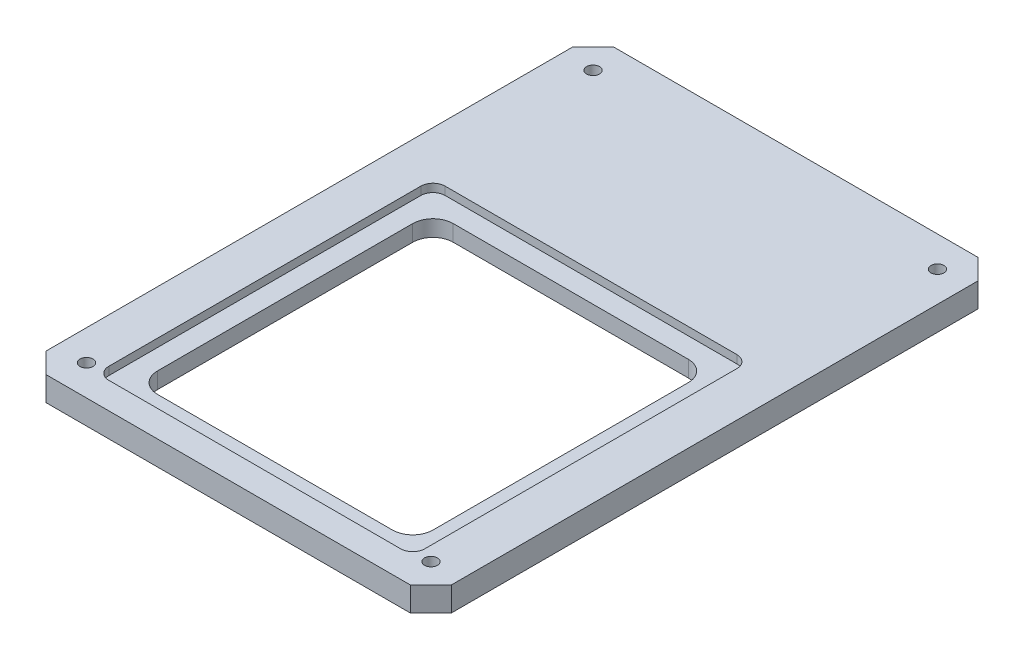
ISO-10303-21;
HEADER;
FILE_DESCRIPTION(('STEP AP214'),'2;1');
FILE_NAME('part.step','',(''),(''),'','','');
FILE_SCHEMA(('AUTOMOTIVE_DESIGN { 1 0 10303 214 1 1 1 1 }'));
ENDSEC;
DATA;
#1=APPLICATION_CONTEXT('core data for automotive mechanical design processes');
#2=APPLICATION_PROTOCOL_DEFINITION('international standard','automotive_design',2000,#1);
#3=PRODUCT_CONTEXT('',#1,'mechanical');
#4=PRODUCT('Part','Part','',(#3));
#5=PRODUCT_RELATED_PRODUCT_CATEGORY('part','',(#4));
#6=PRODUCT_DEFINITION_FORMATION('','',#4);
#7=PRODUCT_DEFINITION_CONTEXT('part definition',#1,'design');
#8=PRODUCT_DEFINITION('design','',#6,#7);
#9=PRODUCT_DEFINITION_SHAPE('','',#8);
#10=(LENGTH_UNIT() NAMED_UNIT(*) SI_UNIT(.MILLI.,.METRE.));
#11=(NAMED_UNIT(*) PLANE_ANGLE_UNIT() SI_UNIT($,.RADIAN.));
#12=(NAMED_UNIT(*) SI_UNIT($,.STERADIAN.) SOLID_ANGLE_UNIT());
#13=UNCERTAINTY_MEASURE_WITH_UNIT(LENGTH_MEASURE(1.E-05),#10,'distance_accuracy_value','');
#14=(GEOMETRIC_REPRESENTATION_CONTEXT(3) GLOBAL_UNCERTAINTY_ASSIGNED_CONTEXT((#13)) GLOBAL_UNIT_ASSIGNED_CONTEXT((#10,
#11,#12)) REPRESENTATION_CONTEXT('',''));
#15=CARTESIAN_POINT('',(0.,0.,0.));
#16=DIRECTION('',(0.,0.,1.));
#17=DIRECTION('',(1.,0.,0.));
#18=AXIS2_PLACEMENT_3D('',#15,#16,#17);
#19=CARTESIAN_POINT('',(18.5,6.,-82.5));
#20=DIRECTION('',(0.,-1.,0.));
#21=DIRECTION('',(0.,0.,-1.));
#22=AXIS2_PLACEMENT_3D('',#19,#20,#21);
#23=CYLINDRICAL_SURFACE('',#22,5.);
#24=DIRECTION('',(0.,-1.,0.));
#25=VECTOR('',#24,1.);
#26=CARTESIAN_POINT('',(18.5,6.,-87.5));
#27=LINE('',#26,#25);
#28=CARTESIAN_POINT('',(18.5,4.,-87.5));
#29=VERTEX_POINT('',#28);
#30=CARTESIAN_POINT('',(18.5,0.,-87.5));
#31=VERTEX_POINT('',#30);
#32=EDGE_CURVE('E312',#29,#31,#27,.T.);
#33=ORIENTED_EDGE('',*,*,#32,.F.);
#34=CARTESIAN_POINT('',(18.5,4.,-82.5));
#35=DIRECTION('',(0.,1.,0.));
#36=DIRECTION('',(0.,0.,1.));
#37=AXIS2_PLACEMENT_3D('',#34,#35,#36);
#38=CIRCLE('',#37,5.);
#39=CARTESIAN_POINT('',(13.5,4.,-82.5));
#40=VERTEX_POINT('',#39);
#41=EDGE_CURVE('E53',#29,#40,#38,.T.);
#42=ORIENTED_EDGE('',*,*,#41,.T.);
#43=DIRECTION('',(0.,-1.,0.));
#44=VECTOR('',#43,1.);
#45=CARTESIAN_POINT('',(13.5,6.,-82.5));
#46=LINE('',#45,#44);
#47=CARTESIAN_POINT('',(13.5,0.,-82.5));
#48=VERTEX_POINT('',#47);
#49=EDGE_CURVE('E326',#40,#48,#46,.T.);
#50=ORIENTED_EDGE('',*,*,#49,.T.);
#51=CARTESIAN_POINT('',(18.5,0.,-82.5));
#52=DIRECTION('',(0.,1.,0.));
#53=DIRECTION('',(0.,0.,1.));
#54=AXIS2_PLACEMENT_3D('',#51,#52,#53);
#55=CIRCLE('',#54,5.);
#56=EDGE_CURVE('E288',#31,#48,#55,.T.);
#57=ORIENTED_EDGE('',*,*,#56,.F.);
#58=EDGE_LOOP('',(#33,#42,#50,#57));
#59=FACE_BOUND('',#58,.T.);
#60=ADVANCED_FACE('F30',(#59),#23,.F.);
#61=CARTESIAN_POINT('',(13.5,6.,-82.5));
#62=DIRECTION('',(1.,0.,0.));
#63=DIRECTION('',(0.,0.,-1.));
#64=AXIS2_PLACEMENT_3D('',#61,#62,#63);
#65=PLANE('',#64);
#66=ORIENTED_EDGE('',*,*,#49,.F.);
#67=DIRECTION('',(0.,0.,1.));
#68=VECTOR('',#67,1.);
#69=CARTESIAN_POINT('',(13.5,4.,-82.5));
#70=LINE('',#69,#68);
#71=CARTESIAN_POINT('',(13.5,4.,-19.5));
#72=VERTEX_POINT('',#71);
#73=EDGE_CURVE('E278',#40,#72,#70,.T.);
#74=ORIENTED_EDGE('',*,*,#73,.T.);
#75=DIRECTION('',(0.,-1.,0.));
#76=VECTOR('',#75,1.);
#77=CARTESIAN_POINT('',(13.5,6.,-19.5));
#78=LINE('',#77,#76);
#79=CARTESIAN_POINT('',(13.5,0.,-19.5));
#80=VERTEX_POINT('',#79);
#81=EDGE_CURVE('E324',#72,#80,#78,.T.);
#82=ORIENTED_EDGE('',*,*,#81,.T.);
#83=DIRECTION('',(0.,0.,1.));
#84=VECTOR('',#83,1.);
#85=CARTESIAN_POINT('',(13.5,0.,-82.5));
#86=LINE('',#85,#84);
#87=EDGE_CURVE('E291',#48,#80,#86,.T.);
#88=ORIENTED_EDGE('',*,*,#87,.F.);
#89=EDGE_LOOP('',(#66,#74,#82,#88));
#90=FACE_BOUND('',#89,.T.);
#91=ADVANCED_FACE('F452',(#90),#65,.T.);
#92=CARTESIAN_POINT('',(18.5,6.,-19.5));
#93=DIRECTION('',(0.,-1.,0.));
#94=DIRECTION('',(0.,0.,-1.));
#95=AXIS2_PLACEMENT_3D('',#92,#93,#94);
#96=CYLINDRICAL_SURFACE('',#95,5.);
#97=ORIENTED_EDGE('',*,*,#81,.F.);
#98=CARTESIAN_POINT('',(18.5,4.,-19.5));
#99=DIRECTION('',(0.,1.,0.));
#100=DIRECTION('',(0.,0.,1.));
#101=AXIS2_PLACEMENT_3D('',#98,#99,#100);
#102=CIRCLE('',#101,5.);
#103=CARTESIAN_POINT('',(18.5,4.,-14.5));
#104=VERTEX_POINT('',#103);
#105=EDGE_CURVE('E275',#72,#104,#102,.T.);
#106=ORIENTED_EDGE('',*,*,#105,.T.);
#107=DIRECTION('',(0.,-1.,0.));
#108=VECTOR('',#107,1.);
#109=CARTESIAN_POINT('',(18.5,6.,-14.5));
#110=LINE('',#109,#108);
#111=CARTESIAN_POINT('',(18.5,0.,-14.5));
#112=VERTEX_POINT('',#111);
#113=EDGE_CURVE('E322',#104,#112,#110,.T.);
#114=ORIENTED_EDGE('',*,*,#113,.T.);
#115=CARTESIAN_POINT('',(18.5,0.,-19.5));
#116=DIRECTION('',(0.,1.,0.));
#117=DIRECTION('',(0.,0.,1.));
#118=AXIS2_PLACEMENT_3D('',#115,#116,#117);
#119=CIRCLE('',#118,5.);
#120=EDGE_CURVE('E294',#80,#112,#119,.T.);
#121=ORIENTED_EDGE('',*,*,#120,.F.);
#122=EDGE_LOOP('',(#97,#106,#114,#121));
#123=FACE_BOUND('',#122,.T.);
#124=ADVANCED_FACE('F458',(#123),#96,.F.);
#125=CARTESIAN_POINT('',(18.5,6.,-14.5));
#126=DIRECTION('',(0.,0.,-1.));
#127=DIRECTION('',(-1.,0.,0.));
#128=AXIS2_PLACEMENT_3D('',#125,#126,#127);
#129=PLANE('',#128);
#130=ORIENTED_EDGE('',*,*,#113,.F.);
#131=DIRECTION('',(1.,0.,0.));
#132=VECTOR('',#131,1.);
#133=CARTESIAN_POINT('',(18.5,4.,-14.5));
#134=LINE('',#133,#132);
#135=CARTESIAN_POINT('',(76.5,4.,-14.5));
#136=VERTEX_POINT('',#135);
#137=EDGE_CURVE('E272',#104,#136,#134,.T.);
#138=ORIENTED_EDGE('',*,*,#137,.T.);
#139=DIRECTION('',(0.,-1.,0.));
#140=VECTOR('',#139,1.);
#141=CARTESIAN_POINT('',(76.5,6.,-14.5));
#142=LINE('',#141,#140);
#143=CARTESIAN_POINT('',(76.5,0.,-14.5));
#144=VERTEX_POINT('',#143);
#145=EDGE_CURVE('E320',#136,#144,#142,.T.);
#146=ORIENTED_EDGE('',*,*,#145,.T.);
#147=DIRECTION('',(1.,0.,0.));
#148=VECTOR('',#147,1.);
#149=CARTESIAN_POINT('',(18.5,0.,-14.5));
#150=LINE('',#149,#148);
#151=EDGE_CURVE('E297',#112,#144,#150,.T.);
#152=ORIENTED_EDGE('',*,*,#151,.F.);
#153=EDGE_LOOP('',(#130,#138,#146,#152));
#154=FACE_BOUND('',#153,.T.);
#155=ADVANCED_FACE('F615',(#154),#129,.T.);
#156=CARTESIAN_POINT('',(76.5,6.,-19.5));
#157=DIRECTION('',(0.,-1.,0.));
#158=DIRECTION('',(0.,0.,-1.));
#159=AXIS2_PLACEMENT_3D('',#156,#157,#158);
#160=CYLINDRICAL_SURFACE('',#159,5.);
#161=ORIENTED_EDGE('',*,*,#145,.F.);
#162=CARTESIAN_POINT('',(76.5,4.,-19.5));
#163=DIRECTION('',(0.,1.,0.));
#164=DIRECTION('',(0.,0.,1.));
#165=AXIS2_PLACEMENT_3D('',#162,#163,#164);
#166=CIRCLE('',#165,5.);
#167=CARTESIAN_POINT('',(81.5,4.,-19.5));
#168=VERTEX_POINT('',#167);
#169=EDGE_CURVE('E269',#136,#168,#166,.T.);
#170=ORIENTED_EDGE('',*,*,#169,.T.);
#171=DIRECTION('',(0.,-1.,0.));
#172=VECTOR('',#171,1.);
#173=CARTESIAN_POINT('',(81.5,6.,-19.5));
#174=LINE('',#173,#172);
#175=CARTESIAN_POINT('',(81.5,0.,-19.5));
#176=VERTEX_POINT('',#175);
#177=EDGE_CURVE('E318',#168,#176,#174,.T.);
#178=ORIENTED_EDGE('',*,*,#177,.T.);
#179=CARTESIAN_POINT('',(76.5,0.,-19.5));
#180=DIRECTION('',(0.,1.,0.));
#181=DIRECTION('',(0.,0.,1.));
#182=AXIS2_PLACEMENT_3D('',#179,#180,#181);
#183=CIRCLE('',#182,5.);
#184=EDGE_CURVE('E300',#144,#176,#183,.T.);
#185=ORIENTED_EDGE('',*,*,#184,.F.);
#186=EDGE_LOOP('',(#161,#170,#178,#185));
#187=FACE_BOUND('',#186,.T.);
#188=ADVANCED_FACE('F623',(#187),#160,.F.);
#189=CARTESIAN_POINT('',(81.5,6.,-82.5));
#190=DIRECTION('',(-1.,0.,0.));
#191=DIRECTION('',(0.,0.,1.));
#192=AXIS2_PLACEMENT_3D('',#189,#190,#191);
#193=PLANE('',#192);
#194=ORIENTED_EDGE('',*,*,#177,.F.);
#195=DIRECTION('',(0.,0.,-1.));
#196=VECTOR('',#195,1.);
#197=CARTESIAN_POINT('',(81.5,4.,-82.5));
#198=LINE('',#197,#196);
#199=CARTESIAN_POINT('',(81.5,4.,-82.5));
#200=VERTEX_POINT('',#199);
#201=EDGE_CURVE('E266',#168,#200,#198,.T.);
#202=ORIENTED_EDGE('',*,*,#201,.T.);
#203=DIRECTION('',(0.,-1.,0.));
#204=VECTOR('',#203,1.);
#205=CARTESIAN_POINT('',(81.5,6.,-82.5));
#206=LINE('',#205,#204);
#207=CARTESIAN_POINT('',(81.5,0.,-82.5));
#208=VERTEX_POINT('',#207);
#209=EDGE_CURVE('E316',#200,#208,#206,.T.);
#210=ORIENTED_EDGE('',*,*,#209,.T.);
#211=DIRECTION('',(0.,0.,-1.));
#212=VECTOR('',#211,1.);
#213=CARTESIAN_POINT('',(81.5,0.,-82.5));
#214=LINE('',#213,#212);
#215=EDGE_CURVE('E303',#176,#208,#214,.T.);
#216=ORIENTED_EDGE('',*,*,#215,.F.);
#217=EDGE_LOOP('',(#194,#202,#210,#216));
#218=FACE_BOUND('',#217,.T.);
#219=ADVANCED_FACE('F632',(#218),#193,.T.);
#220=CARTESIAN_POINT('',(76.5,6.,-82.5));
#221=DIRECTION('',(0.,-1.,0.));
#222=DIRECTION('',(0.,0.,-1.));
#223=AXIS2_PLACEMENT_3D('',#220,#221,#222);
#224=CYLINDRICAL_SURFACE('',#223,5.);
#225=ORIENTED_EDGE('',*,*,#209,.F.);
#226=CARTESIAN_POINT('',(76.5,4.,-82.5));
#227=DIRECTION('',(0.,1.,0.));
#228=DIRECTION('',(0.,0.,1.));
#229=AXIS2_PLACEMENT_3D('',#226,#227,#228);
#230=CIRCLE('',#229,5.);
#231=CARTESIAN_POINT('',(76.5,4.,-87.5));
#232=VERTEX_POINT('',#231);
#233=EDGE_CURVE('E253',#200,#232,#230,.T.);
#234=ORIENTED_EDGE('',*,*,#233,.T.);
#235=DIRECTION('',(0.,-1.,0.));
#236=VECTOR('',#235,1.);
#237=CARTESIAN_POINT('',(76.5,6.,-87.5));
#238=LINE('',#237,#236);
#239=CARTESIAN_POINT('',(76.5,0.,-87.5));
#240=VERTEX_POINT('',#239);
#241=EDGE_CURVE('E314',#232,#240,#238,.T.);
#242=ORIENTED_EDGE('',*,*,#241,.T.);
#243=CARTESIAN_POINT('',(76.5,0.,-82.5));
#244=DIRECTION('',(0.,1.,0.));
#245=DIRECTION('',(0.,0.,-1.));
#246=AXIS2_PLACEMENT_3D('',#243,#244,#245);
#247=CIRCLE('',#246,5.);
#248=EDGE_CURVE('E306',#208,#240,#247,.T.);
#249=ORIENTED_EDGE('',*,*,#248,.F.);
#250=EDGE_LOOP('',(#225,#234,#242,#249));
#251=FACE_BOUND('',#250,.T.);
#252=ADVANCED_FACE('F641',(#251),#224,.F.);
#253=CARTESIAN_POINT('',(18.5,6.,-87.5));
#254=DIRECTION('',(0.,0.,1.));
#255=DIRECTION('',(1.,0.,0.));
#256=AXIS2_PLACEMENT_3D('',#253,#254,#255);
#257=PLANE('',#256);
#258=ORIENTED_EDGE('',*,*,#241,.F.);
#259=DIRECTION('',(-1.,0.,0.));
#260=VECTOR('',#259,1.);
#261=CARTESIAN_POINT('',(18.5,4.,-87.5));
#262=LINE('',#261,#260);
#263=EDGE_CURVE('E11',#232,#29,#262,.T.);
#264=ORIENTED_EDGE('',*,*,#263,.T.);
#265=ORIENTED_EDGE('',*,*,#32,.T.);
#266=DIRECTION('',(-1.,0.,0.));
#267=VECTOR('',#266,1.);
#268=CARTESIAN_POINT('',(18.5,0.,-87.5));
#269=LINE('',#268,#267);
#270=EDGE_CURVE('E309',#240,#31,#269,.T.);
#271=ORIENTED_EDGE('',*,*,#270,.F.);
#272=EDGE_LOOP('',(#258,#264,#265,#271));
#273=FACE_BOUND('',#272,.T.);
#274=ADVANCED_FACE('F482',(#273),#257,.T.);
#275=CARTESIAN_POINT('',(-2.49999999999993,6.,-2.97155253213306));
#276=DIRECTION('',(0.,-1.,0.));
#277=DIRECTION('',(0.,0.,-1.));
#278=AXIS2_PLACEMENT_3D('',#275,#276,#277);
#279=PLANE('',#278);
#280=DIRECTION('',(0.,0.,1.));
#281=VECTOR('',#280,1.);
#282=CARTESIAN_POINT('',(8.49999999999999,6.,-89.5));
#283=LINE('',#282,#281);
#284=CARTESIAN_POINT('',(8.49999999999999,6.,-89.5));
#285=VERTEX_POINT('',#284);
#286=CARTESIAN_POINT('',(8.49999999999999,6.,-12.5));
#287=VERTEX_POINT('',#286);
#288=EDGE_CURVE('E205',#285,#287,#283,.T.);
#289=ORIENTED_EDGE('',*,*,#288,.F.);
#290=CARTESIAN_POINT('',(11.5,6.,-89.5));
#291=DIRECTION('',(0.,1.,0.));
#292=DIRECTION('',(0.,0.,1.));
#293=AXIS2_PLACEMENT_3D('',#290,#291,#292);
#294=CIRCLE('',#293,3.);
#295=CARTESIAN_POINT('',(11.5,6.,-92.5));
#296=VERTEX_POINT('',#295);
#297=EDGE_CURVE('E45',#296,#285,#294,.T.);
#298=ORIENTED_EDGE('',*,*,#297,.F.);
#299=DIRECTION('',(-1.,0.,0.));
#300=VECTOR('',#299,1.);
#301=CARTESIAN_POINT('',(11.5,6.,-92.5));
#302=LINE('',#301,#300);
#303=CARTESIAN_POINT('',(83.5,6.,-92.5));
#304=VERTEX_POINT('',#303);
#305=EDGE_CURVE('E227',#304,#296,#302,.T.);
#306=ORIENTED_EDGE('',*,*,#305,.F.);
#307=CARTESIAN_POINT('',(83.5,6.,-89.5));
#308=DIRECTION('',(0.,1.,0.));
#309=DIRECTION('',(0.,0.,-1.));
#310=AXIS2_PLACEMENT_3D('',#307,#308,#309);
#311=CIRCLE('',#310,3.);
#312=CARTESIAN_POINT('',(86.5,6.,-89.5));
#313=VERTEX_POINT('',#312);
#314=EDGE_CURVE('E224',#313,#304,#311,.T.);
#315=ORIENTED_EDGE('',*,*,#314,.F.);
#316=DIRECTION('',(0.,0.,-1.));
#317=VECTOR('',#316,1.);
#318=CARTESIAN_POINT('',(86.5,6.,-89.5));
#319=LINE('',#318,#317);
#320=CARTESIAN_POINT('',(86.5,6.,-12.5));
#321=VERTEX_POINT('',#320);
#322=EDGE_CURVE('E221',#321,#313,#319,.T.);
#323=ORIENTED_EDGE('',*,*,#322,.F.);
#324=CARTESIAN_POINT('',(83.5,6.,-12.5));
#325=DIRECTION('',(0.,1.,0.));
#326=DIRECTION('',(0.,0.,1.));
#327=AXIS2_PLACEMENT_3D('',#324,#325,#326);
#328=CIRCLE('',#327,3.);
#329=CARTESIAN_POINT('',(83.5,6.,-9.5));
#330=VERTEX_POINT('',#329);
#331=EDGE_CURVE('E215',#330,#321,#328,.T.);
#332=ORIENTED_EDGE('',*,*,#331,.F.);
#333=DIRECTION('',(1.,0.,0.));
#334=VECTOR('',#333,1.);
#335=CARTESIAN_POINT('',(11.5,6.,-9.5));
#336=LINE('',#335,#334);
#337=CARTESIAN_POINT('',(11.5,6.,-9.5));
#338=VERTEX_POINT('',#337);
#339=EDGE_CURVE('E213',#338,#330,#336,.T.);
#340=ORIENTED_EDGE('',*,*,#339,.F.);
#341=CARTESIAN_POINT('',(11.5,6.,-12.5));
#342=DIRECTION('',(0.,1.,0.));
#343=DIRECTION('',(0.,0.,1.));
#344=AXIS2_PLACEMENT_3D('',#341,#342,#343);
#345=CIRCLE('',#344,3.);
#346=EDGE_CURVE('E194',#287,#338,#345,.T.);
#347=ORIENTED_EDGE('',*,*,#346,.F.);
#348=EDGE_LOOP('',(#289,#298,#306,#315,#323,#332,#340,#347));
#349=FACE_BOUND('',#348,.T.);
#350=CARTESIAN_POINT('',(90.,6.,-10.5));
#351=DIRECTION('',(0.,1.,0.));
#352=DIRECTION('',(0.,0.,-1.));
#353=AXIS2_PLACEMENT_3D('',#350,#351,#352);
#354=CIRCLE('',#353,1.59999999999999);
#355=CARTESIAN_POINT('',(90.,6.,-12.1));
#356=VERTEX_POINT('',#355);
#357=EDGE_CURVE('E337',#356,#356,#354,.T.);
#358=ORIENTED_EDGE('',*,*,#357,.F.);
#359=EDGE_LOOP('',(#358));
#360=FACE_BOUND('',#359,.T.);
#361=DIRECTION('',(1.,0.,0.));
#362=VECTOR('',#361,1.);
#363=CARTESIAN_POINT('',(92.4715525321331,6.,-2.97155253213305));
#364=LINE('',#363,#362);
#365=CARTESIAN_POINT('',(2.52844746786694,6.,-2.97155253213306));
#366=VERTEX_POINT('',#365);
#367=CARTESIAN_POINT('',(92.4715525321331,6.,-2.97155253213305));
#368=VERTEX_POINT('',#367);
#369=EDGE_CURVE('E363',#366,#368,#364,.T.);
#370=ORIENTED_EDGE('',*,*,#369,.T.);
#371=DIRECTION('',(0.705527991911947,0.,-0.708682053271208));
#372=VECTOR('',#371,1.);
#373=CARTESIAN_POINT('',(97.4999999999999,6.,-8.02247966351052));
#374=LINE('',#373,#372);
#375=CARTESIAN_POINT('',(97.4999999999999,6.,-8.02247966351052));
#376=VERTEX_POINT('',#375);
#377=EDGE_CURVE('E366',#368,#376,#374,.T.);
#378=ORIENTED_EDGE('',*,*,#377,.T.);
#379=DIRECTION('',(0.,0.,-1.));
#380=VECTOR('',#379,1.);
#381=CARTESIAN_POINT('',(97.4999999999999,6.,-137.97752033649));
#382=LINE('',#381,#380);
#383=CARTESIAN_POINT('',(97.4999999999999,6.,-137.97752033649));
#384=VERTEX_POINT('',#383);
#385=EDGE_CURVE('E368',#376,#384,#382,.T.);
#386=ORIENTED_EDGE('',*,*,#385,.T.);
#387=DIRECTION('',(-0.705527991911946,0.,-0.708682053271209));
#388=VECTOR('',#387,1.);
#389=CARTESIAN_POINT('',(97.4999999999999,6.,-137.97752033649));
#390=LINE('',#389,#388);
#391=CARTESIAN_POINT('',(92.4715525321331,6.,-143.028447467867));
#392=VERTEX_POINT('',#391);
#393=EDGE_CURVE('E370',#384,#392,#390,.T.);
#394=ORIENTED_EDGE('',*,*,#393,.T.);
#395=DIRECTION('',(-1.,0.,0.));
#396=VECTOR('',#395,1.);
#397=CARTESIAN_POINT('',(2.52844746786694,6.,-143.028447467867));
#398=LINE('',#397,#396);
#399=CARTESIAN_POINT('',(2.52844746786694,6.,-143.028447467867));
#400=VERTEX_POINT('',#399);
#401=EDGE_CURVE('E372',#392,#400,#398,.T.);
#402=ORIENTED_EDGE('',*,*,#401,.T.);
#403=DIRECTION('',(-0.705527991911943,0.,0.708682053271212));
#404=VECTOR('',#403,1.);
#405=CARTESIAN_POINT('',(-2.49999999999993,6.,-137.977520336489));
#406=LINE('',#405,#404);
#407=CARTESIAN_POINT('',(-2.49999999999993,6.,-137.977520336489));
#408=VERTEX_POINT('',#407);
#409=EDGE_CURVE('E374',#400,#408,#406,.T.);
#410=ORIENTED_EDGE('',*,*,#409,.T.);
#411=DIRECTION('',(0.,0.,1.));
#412=VECTOR('',#411,1.);
#413=CARTESIAN_POINT('',(-2.49999999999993,6.,-8.02247966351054));
#414=LINE('',#413,#412);
#415=CARTESIAN_POINT('',(-2.49999999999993,6.,-8.02247966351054));
#416=VERTEX_POINT('',#415);
#417=EDGE_CURVE('E376',#408,#416,#414,.T.);
#418=ORIENTED_EDGE('',*,*,#417,.T.);
#419=DIRECTION('',(0.705527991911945,0.,0.70868205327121));
#420=VECTOR('',#419,1.);
#421=CARTESIAN_POINT('',(-2.49999999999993,6.,-8.02247966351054));
#422=LINE('',#421,#420);
#423=EDGE_CURVE('E378',#416,#366,#422,.T.);
#424=ORIENTED_EDGE('',*,*,#423,.T.);
#425=EDGE_LOOP('',(#370,#378,#386,#394,#402,#410,#418,#424));
#426=FACE_BOUND('',#425,.T.);
#427=CARTESIAN_POINT('',(5.,6.,-10.5));
#428=DIRECTION('',(0.,1.,0.));
#429=DIRECTION('',(0.,0.,1.));
#430=AXIS2_PLACEMENT_3D('',#427,#428,#429);
#431=CIRCLE('',#430,1.6);
#432=CARTESIAN_POINT('',(5.,6.,-8.90000000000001));
#433=VERTEX_POINT('',#432);
#434=EDGE_CURVE('E343',#433,#433,#431,.T.);
#435=ORIENTED_EDGE('',*,*,#434,.F.);
#436=EDGE_LOOP('',(#435));
#437=FACE_BOUND('',#436,.T.);
#438=CARTESIAN_POINT('',(90.,6.,-135.5));
#439=DIRECTION('',(0.,1.,0.));
#440=DIRECTION('',(0.,0.,1.));
#441=AXIS2_PLACEMENT_3D('',#438,#439,#440);
#442=CIRCLE('',#441,1.59999999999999);
#443=CARTESIAN_POINT('',(90.,6.,-133.9));
#444=VERTEX_POINT('',#443);
#445=EDGE_CURVE('E331',#444,#444,#442,.T.);
#446=ORIENTED_EDGE('',*,*,#445,.F.);
#447=EDGE_LOOP('',(#446));
#448=FACE_BOUND('',#447,.T.);
#449=CARTESIAN_POINT('',(5.,6.,-135.5));
#450=DIRECTION('',(0.,1.,0.));
#451=DIRECTION('',(0.,0.,-1.));
#452=AXIS2_PLACEMENT_3D('',#449,#450,#451);
#453=CIRCLE('',#452,1.6);
#454=CARTESIAN_POINT('',(5.,6.,-137.1));
#455=VERTEX_POINT('',#454);
#456=EDGE_CURVE('E285',#455,#455,#453,.T.);
#457=ORIENTED_EDGE('',*,*,#456,.F.);
#458=EDGE_LOOP('',(#457));
#459=FACE_BOUND('',#458,.T.);
#460=ADVANCED_FACE('F209',(#349,#360,#426,#437,#448,#459),#279,.F.);
#461=CARTESIAN_POINT('',(-2.49999999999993,0.,-2.97155253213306));
#462=DIRECTION('',(0.,-1.,0.));
#463=DIRECTION('',(0.,0.,-1.));
#464=AXIS2_PLACEMENT_3D('',#461,#462,#463);
#465=PLANE('',#464);
#466=ORIENTED_EDGE('',*,*,#270,.T.);
#467=ORIENTED_EDGE('',*,*,#56,.T.);
#468=ORIENTED_EDGE('',*,*,#87,.T.);
#469=ORIENTED_EDGE('',*,*,#120,.T.);
#470=ORIENTED_EDGE('',*,*,#151,.T.);
#471=ORIENTED_EDGE('',*,*,#184,.T.);
#472=ORIENTED_EDGE('',*,*,#215,.T.);
#473=ORIENTED_EDGE('',*,*,#248,.T.);
#474=EDGE_LOOP('',(#466,#467,#468,#469,#470,#471,#472,#473));
#475=FACE_BOUND('',#474,.T.);
#476=CARTESIAN_POINT('',(90.,0.,-10.5));
#477=DIRECTION('',(0.,1.,0.));
#478=DIRECTION('',(0.,0.,-1.));
#479=AXIS2_PLACEMENT_3D('',#476,#477,#478);
#480=CIRCLE('',#479,1.59999999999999);
#481=CARTESIAN_POINT('',(90.,0.,-12.1));
#482=VERTEX_POINT('',#481);
#483=EDGE_CURVE('E334',#482,#482,#480,.T.);
#484=ORIENTED_EDGE('',*,*,#483,.T.);
#485=EDGE_LOOP('',(#484));
#486=FACE_BOUND('',#485,.T.);
#487=DIRECTION('',(1.,0.,0.));
#488=VECTOR('',#487,1.);
#489=CARTESIAN_POINT('',(92.4715525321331,0.,-2.97155253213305));
#490=LINE('',#489,#488);
#491=CARTESIAN_POINT('',(2.52844746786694,0.,-2.97155253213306));
#492=VERTEX_POINT('',#491);
#493=CARTESIAN_POINT('',(92.4715525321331,0.,-2.97155253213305));
#494=VERTEX_POINT('',#493);
#495=EDGE_CURVE('E346',#492,#494,#490,.T.);
#496=ORIENTED_EDGE('',*,*,#495,.F.);
#497=DIRECTION('',(0.705527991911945,0.,0.70868205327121));
#498=VECTOR('',#497,1.);
#499=CARTESIAN_POINT('',(-2.49999999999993,0.,-8.02247966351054));
#500=LINE('',#499,#498);
#501=CARTESIAN_POINT('',(-2.49999999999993,0.,-8.02247966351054));
#502=VERTEX_POINT('',#501);
#503=EDGE_CURVE('E361',#502,#492,#500,.T.);
#504=ORIENTED_EDGE('',*,*,#503,.F.);
#505=DIRECTION('',(0.,0.,1.));
#506=VECTOR('',#505,1.);
#507=CARTESIAN_POINT('',(-2.49999999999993,0.,-8.02247966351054));
#508=LINE('',#507,#506);
#509=CARTESIAN_POINT('',(-2.49999999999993,0.,-137.977520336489));
#510=VERTEX_POINT('',#509);
#511=EDGE_CURVE('E359',#510,#502,#508,.T.);
#512=ORIENTED_EDGE('',*,*,#511,.F.);
#513=DIRECTION('',(-0.705527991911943,0.,0.708682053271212));
#514=VECTOR('',#513,1.);
#515=CARTESIAN_POINT('',(-2.49999999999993,0.,-137.977520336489));
#516=LINE('',#515,#514);
#517=CARTESIAN_POINT('',(2.52844746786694,0.,-143.028447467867));
#518=VERTEX_POINT('',#517);
#519=EDGE_CURVE('E357',#518,#510,#516,.T.);
#520=ORIENTED_EDGE('',*,*,#519,.F.);
#521=DIRECTION('',(-1.,0.,0.));
#522=VECTOR('',#521,1.);
#523=CARTESIAN_POINT('',(2.52844746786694,0.,-143.028447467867));
#524=LINE('',#523,#522);
#525=CARTESIAN_POINT('',(92.4715525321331,0.,-143.028447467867));
#526=VERTEX_POINT('',#525);
#527=EDGE_CURVE('E355',#526,#518,#524,.T.);
#528=ORIENTED_EDGE('',*,*,#527,.F.);
#529=DIRECTION('',(-0.705527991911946,0.,-0.708682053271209));
#530=VECTOR('',#529,1.);
#531=CARTESIAN_POINT('',(97.4999999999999,0.,-137.97752033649));
#532=LINE('',#531,#530);
#533=CARTESIAN_POINT('',(97.4999999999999,0.,-137.97752033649));
#534=VERTEX_POINT('',#533);
#535=EDGE_CURVE('E353',#534,#526,#532,.T.);
#536=ORIENTED_EDGE('',*,*,#535,.F.);
#537=DIRECTION('',(0.,0.,-1.));
#538=VECTOR('',#537,1.);
#539=CARTESIAN_POINT('',(97.4999999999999,0.,-137.97752033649));
#540=LINE('',#539,#538);
#541=CARTESIAN_POINT('',(97.4999999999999,0.,-8.02247966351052));
#542=VERTEX_POINT('',#541);
#543=EDGE_CURVE('E351',#542,#534,#540,.T.);
#544=ORIENTED_EDGE('',*,*,#543,.F.);
#545=DIRECTION('',(0.705527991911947,0.,-0.708682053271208));
#546=VECTOR('',#545,1.);
#547=CARTESIAN_POINT('',(97.4999999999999,0.,-8.02247966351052));
#548=LINE('',#547,#546);
#549=EDGE_CURVE('E349',#494,#542,#548,.T.);
#550=ORIENTED_EDGE('',*,*,#549,.F.);
#551=EDGE_LOOP('',(#496,#504,#512,#520,#528,#536,#544,#550));
#552=FACE_BOUND('',#551,.T.);
#553=CARTESIAN_POINT('',(5.,0.,-10.5));
#554=DIRECTION('',(0.,1.,0.));
#555=DIRECTION('',(0.,0.,1.));
#556=AXIS2_PLACEMENT_3D('',#553,#554,#555);
#557=CIRCLE('',#556,1.6);
#558=CARTESIAN_POINT('',(5.,0.,-8.90000000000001));
#559=VERTEX_POINT('',#558);
#560=EDGE_CURVE('E340',#559,#559,#557,.T.);
#561=ORIENTED_EDGE('',*,*,#560,.T.);
#562=EDGE_LOOP('',(#561));
#563=FACE_BOUND('',#562,.T.);
#564=CARTESIAN_POINT('',(90.,0.,-135.5));
#565=DIRECTION('',(0.,1.,0.));
#566=DIRECTION('',(0.,0.,1.));
#567=AXIS2_PLACEMENT_3D('',#564,#565,#566);
#568=CIRCLE('',#567,1.59999999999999);
#569=CARTESIAN_POINT('',(90.,0.,-133.9));
#570=VERTEX_POINT('',#569);
#571=EDGE_CURVE('E328',#570,#570,#568,.T.);
#572=ORIENTED_EDGE('',*,*,#571,.T.);
#573=EDGE_LOOP('',(#572));
#574=FACE_BOUND('',#573,.T.);
#575=CARTESIAN_POINT('',(5.,0.,-135.5));
#576=DIRECTION('',(0.,1.,0.));
#577=DIRECTION('',(0.,0.,-1.));
#578=AXIS2_PLACEMENT_3D('',#575,#576,#577);
#579=CIRCLE('',#578,1.6);
#580=CARTESIAN_POINT('',(5.,0.,-137.1));
#581=VERTEX_POINT('',#580);
#582=EDGE_CURVE('E282',#581,#581,#579,.T.);
#583=ORIENTED_EDGE('',*,*,#582,.T.);
#584=EDGE_LOOP('',(#583));
#585=FACE_BOUND('',#584,.T.);
#586=ADVANCED_FACE('F411',(#475,#486,#552,#563,#574,#585),#465,.T.);
#587=CARTESIAN_POINT('',(92.4715525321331,6.,-2.97155253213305));
#588=DIRECTION('',(0.,0.,-1.));
#589=DIRECTION('',(-1.,0.,0.));
#590=AXIS2_PLACEMENT_3D('',#587,#588,#589);
#591=PLANE('',#590);
#592=ORIENTED_EDGE('',*,*,#495,.T.);
#593=DIRECTION('',(0.,-1.,0.));
#594=VECTOR('',#593,1.);
#595=CARTESIAN_POINT('',(92.4715525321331,6.,-2.97155253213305));
#596=LINE('',#595,#594);
#597=EDGE_CURVE('E38',#368,#494,#596,.T.);
#598=ORIENTED_EDGE('',*,*,#597,.F.);
#599=ORIENTED_EDGE('',*,*,#369,.F.);
#600=DIRECTION('',(0.,-1.,0.));
#601=VECTOR('',#600,1.);
#602=CARTESIAN_POINT('',(2.52844746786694,6.,-2.97155253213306));
#603=LINE('',#602,#601);
#604=EDGE_CURVE('E380',#366,#492,#603,.T.);
#605=ORIENTED_EDGE('',*,*,#604,.T.);
#606=EDGE_LOOP('',(#592,#598,#599,#605));
#607=FACE_BOUND('',#606,.T.);
#608=ADVANCED_FACE('F32',(#607),#591,.F.);
#609=CARTESIAN_POINT('',(97.4999999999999,6.,-8.02247966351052));
#610=DIRECTION('',(-0.708682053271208,0.,-0.705527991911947));
#611=DIRECTION('',(-0.705527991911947,0.,0.708682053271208));
#612=AXIS2_PLACEMENT_3D('',#609,#610,#611);
#613=PLANE('',#612);
#614=ORIENTED_EDGE('',*,*,#549,.T.);
#615=DIRECTION('',(0.,-1.,0.));
#616=VECTOR('',#615,1.);
#617=CARTESIAN_POINT('',(97.4999999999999,6.,-8.02247966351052));
#618=LINE('',#617,#616);
#619=EDGE_CURVE('E398',#376,#542,#618,.T.);
#620=ORIENTED_EDGE('',*,*,#619,.F.);
#621=ORIENTED_EDGE('',*,*,#377,.F.);
#622=ORIENTED_EDGE('',*,*,#597,.T.);
#623=EDGE_LOOP('',(#614,#620,#621,#622));
#624=FACE_BOUND('',#623,.T.);
#625=ADVANCED_FACE('F403',(#624),#613,.F.);
#626=CARTESIAN_POINT('',(97.4999999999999,6.,-137.97752033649));
#627=DIRECTION('',(-1.,0.,0.));
#628=DIRECTION('',(0.,0.,1.));
#629=AXIS2_PLACEMENT_3D('',#626,#627,#628);
#630=PLANE('',#629);
#631=ORIENTED_EDGE('',*,*,#543,.T.);
#632=DIRECTION('',(0.,-1.,0.));
#633=VECTOR('',#632,1.);
#634=CARTESIAN_POINT('',(97.4999999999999,6.,-137.97752033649));
#635=LINE('',#634,#633);
#636=EDGE_CURVE('E395',#384,#534,#635,.T.);
#637=ORIENTED_EDGE('',*,*,#636,.F.);
#638=ORIENTED_EDGE('',*,*,#385,.F.);
#639=ORIENTED_EDGE('',*,*,#619,.T.);
#640=EDGE_LOOP('',(#631,#637,#638,#639));
#641=FACE_BOUND('',#640,.T.);
#642=ADVANCED_FACE('F419',(#641),#630,.F.);
#643=CARTESIAN_POINT('',(97.4999999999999,6.,-137.97752033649));
#644=DIRECTION('',(-0.708682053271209,0.,0.705527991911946));
#645=DIRECTION('',(0.705527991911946,0.,0.708682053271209));
#646=AXIS2_PLACEMENT_3D('',#643,#644,#645);
#647=PLANE('',#646);
#648=ORIENTED_EDGE('',*,*,#535,.T.);
#649=DIRECTION('',(0.,-1.,0.));
#650=VECTOR('',#649,1.);
#651=CARTESIAN_POINT('',(92.4715525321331,6.,-143.028447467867));
#652=LINE('',#651,#650);
#653=EDGE_CURVE('E392',#392,#526,#652,.T.);
#654=ORIENTED_EDGE('',*,*,#653,.F.);
#655=ORIENTED_EDGE('',*,*,#393,.F.);
#656=ORIENTED_EDGE('',*,*,#636,.T.);
#657=EDGE_LOOP('',(#648,#654,#655,#656));
#658=FACE_BOUND('',#657,.T.);
#659=ADVANCED_FACE('F423',(#658),#647,.F.);
#660=CARTESIAN_POINT('',(2.52844746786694,6.,-143.028447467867));
#661=DIRECTION('',(0.,0.,1.));
#662=DIRECTION('',(1.,0.,0.));
#663=AXIS2_PLACEMENT_3D('',#660,#661,#662);
#664=PLANE('',#663);
#665=ORIENTED_EDGE('',*,*,#527,.T.);
#666=DIRECTION('',(0.,-1.,0.));
#667=VECTOR('',#666,1.);
#668=CARTESIAN_POINT('',(2.52844746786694,6.,-143.028447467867));
#669=LINE('',#668,#667);
#670=EDGE_CURVE('E389',#400,#518,#669,.T.);
#671=ORIENTED_EDGE('',*,*,#670,.F.);
#672=ORIENTED_EDGE('',*,*,#401,.F.);
#673=ORIENTED_EDGE('',*,*,#653,.T.);
#674=EDGE_LOOP('',(#665,#671,#672,#673));
#675=FACE_BOUND('',#674,.T.);
#676=ADVANCED_FACE('F442',(#675),#664,.F.);
#677=CARTESIAN_POINT('',(-2.49999999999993,6.,-137.977520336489));
#678=DIRECTION('',(0.708682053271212,0.,0.705527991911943));
#679=DIRECTION('',(0.705527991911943,0.,-0.708682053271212));
#680=AXIS2_PLACEMENT_3D('',#677,#678,#679);
#681=PLANE('',#680);
#682=ORIENTED_EDGE('',*,*,#519,.T.);
#683=DIRECTION('',(0.,-1.,0.));
#684=VECTOR('',#683,1.);
#685=CARTESIAN_POINT('',(-2.49999999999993,6.,-137.977520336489));
#686=LINE('',#685,#684);
#687=EDGE_CURVE('E386',#408,#510,#686,.T.);
#688=ORIENTED_EDGE('',*,*,#687,.F.);
#689=ORIENTED_EDGE('',*,*,#409,.F.);
#690=ORIENTED_EDGE('',*,*,#670,.T.);
#691=EDGE_LOOP('',(#682,#688,#689,#690));
#692=FACE_BOUND('',#691,.T.);
#693=ADVANCED_FACE('F439',(#692),#681,.F.);
#694=CARTESIAN_POINT('',(-2.49999999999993,6.,-8.02247966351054));
#695=DIRECTION('',(1.,0.,0.));
#696=DIRECTION('',(0.,0.,-1.));
#697=AXIS2_PLACEMENT_3D('',#694,#695,#696);
#698=PLANE('',#697);
#699=ORIENTED_EDGE('',*,*,#511,.T.);
#700=DIRECTION('',(0.,-1.,0.));
#701=VECTOR('',#700,1.);
#702=CARTESIAN_POINT('',(-2.49999999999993,6.,-8.02247966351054));
#703=LINE('',#702,#701);
#704=EDGE_CURVE('E383',#416,#502,#703,.T.);
#705=ORIENTED_EDGE('',*,*,#704,.F.);
#706=ORIENTED_EDGE('',*,*,#417,.F.);
#707=ORIENTED_EDGE('',*,*,#687,.T.);
#708=EDGE_LOOP('',(#699,#705,#706,#707));
#709=FACE_BOUND('',#708,.T.);
#710=ADVANCED_FACE('F435',(#709),#698,.F.);
#711=CARTESIAN_POINT('',(-2.49999999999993,6.,-8.02247966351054));
#712=DIRECTION('',(0.70868205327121,0.,-0.705527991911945));
#713=DIRECTION('',(-0.705527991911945,0.,-0.70868205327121));
#714=AXIS2_PLACEMENT_3D('',#711,#712,#713);
#715=PLANE('',#714);
#716=ORIENTED_EDGE('',*,*,#503,.T.);
#717=ORIENTED_EDGE('',*,*,#604,.F.);
#718=ORIENTED_EDGE('',*,*,#423,.F.);
#719=ORIENTED_EDGE('',*,*,#704,.T.);
#720=EDGE_LOOP('',(#716,#717,#718,#719));
#721=FACE_BOUND('',#720,.T.);
#722=ADVANCED_FACE('F433',(#721),#715,.F.);
#723=CARTESIAN_POINT('',(5.,6.,-10.5));
#724=DIRECTION('',(0.,-1.,0.));
#725=DIRECTION('',(0.,0.,-1.));
#726=AXIS2_PLACEMENT_3D('',#723,#724,#725);
#727=CYLINDRICAL_SURFACE('',#726,1.6);
#728=ORIENTED_EDGE('',*,*,#434,.T.);
#729=EDGE_LOOP('',(#728));
#730=FACE_BOUND('',#729,.T.);
#731=ORIENTED_EDGE('',*,*,#560,.F.);
#732=EDGE_LOOP('',(#731));
#733=FACE_BOUND('',#732,.T.);
#734=ADVANCED_FACE('F472',(#730,#733),#727,.F.);
#735=CARTESIAN_POINT('',(90.,6.,-10.5));
#736=DIRECTION('',(0.,-1.,0.));
#737=DIRECTION('',(0.,0.,-1.));
#738=AXIS2_PLACEMENT_3D('',#735,#736,#737);
#739=CYLINDRICAL_SURFACE('',#738,1.59999999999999);
#740=ORIENTED_EDGE('',*,*,#357,.T.);
#741=EDGE_LOOP('',(#740));
#742=FACE_BOUND('',#741,.T.);
#743=ORIENTED_EDGE('',*,*,#483,.F.);
#744=EDGE_LOOP('',(#743));
#745=FACE_BOUND('',#744,.T.);
#746=ADVANCED_FACE('F468',(#742,#745),#739,.F.);
#747=CARTESIAN_POINT('',(90.,6.,-135.5));
#748=DIRECTION('',(0.,-1.,0.));
#749=DIRECTION('',(0.,0.,-1.));
#750=AXIS2_PLACEMENT_3D('',#747,#748,#749);
#751=CYLINDRICAL_SURFACE('',#750,1.59999999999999);
#752=ORIENTED_EDGE('',*,*,#445,.T.);
#753=EDGE_LOOP('',(#752));
#754=FACE_BOUND('',#753,.T.);
#755=ORIENTED_EDGE('',*,*,#571,.F.);
#756=EDGE_LOOP('',(#755));
#757=FACE_BOUND('',#756,.T.);
#758=ADVANCED_FACE('F464',(#754,#757),#751,.F.);
#759=CARTESIAN_POINT('',(5.,6.,-135.5));
#760=DIRECTION('',(0.,-1.,0.));
#761=DIRECTION('',(0.,0.,-1.));
#762=AXIS2_PLACEMENT_3D('',#759,#760,#761);
#763=CYLINDRICAL_SURFACE('',#762,1.6);
#764=ORIENTED_EDGE('',*,*,#456,.T.);
#765=EDGE_LOOP('',(#764));
#766=FACE_BOUND('',#765,.T.);
#767=ORIENTED_EDGE('',*,*,#582,.F.);
#768=EDGE_LOOP('',(#767));
#769=FACE_BOUND('',#768,.T.);
#770=ADVANCED_FACE('F467',(#766,#769),#763,.F.);
#771=CARTESIAN_POINT('',(11.5,4.,-89.5));
#772=DIRECTION('',(0.,1.,0.));
#773=DIRECTION('',(0.,0.,1.));
#774=AXIS2_PLACEMENT_3D('',#771,#772,#773);
#775=CYLINDRICAL_SURFACE('',#774,3.);
#776=ORIENTED_EDGE('',*,*,#297,.T.);
#777=DIRECTION('',(0.,1.,0.));
#778=VECTOR('',#777,1.);
#779=CARTESIAN_POINT('',(8.49999999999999,4.,-89.5));
#780=LINE('',#779,#778);
#781=CARTESIAN_POINT('',(8.49999999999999,4.,-89.5));
#782=VERTEX_POINT('',#781);
#783=EDGE_CURVE('E202',#782,#285,#780,.T.);
#784=ORIENTED_EDGE('',*,*,#783,.F.);
#785=CARTESIAN_POINT('',(11.5,4.,-89.5));
#786=DIRECTION('',(0.,1.,0.));
#787=DIRECTION('',(0.,0.,1.));
#788=AXIS2_PLACEMENT_3D('',#785,#786,#787);
#789=CIRCLE('',#788,3.);
#790=CARTESIAN_POINT('',(11.5,4.,-92.5));
#791=VERTEX_POINT('',#790);
#792=EDGE_CURVE('E230',#791,#782,#789,.T.);
#793=ORIENTED_EDGE('',*,*,#792,.F.);
#794=DIRECTION('',(0.,1.,0.));
#795=VECTOR('',#794,1.);
#796=CARTESIAN_POINT('',(11.5,4.,-92.5));
#797=LINE('',#796,#795);
#798=EDGE_CURVE('E251',#791,#296,#797,.T.);
#799=ORIENTED_EDGE('',*,*,#798,.T.);
#800=EDGE_LOOP('',(#776,#784,#793,#799));
#801=FACE_BOUND('',#800,.T.);
#802=ADVANCED_FACE('F512',(#801),#775,.F.);
#803=CARTESIAN_POINT('',(11.5,4.,-92.5));
#804=DIRECTION('',(0.,0.,-1.));
#805=DIRECTION('',(-1.,0.,0.));
#806=AXIS2_PLACEMENT_3D('',#803,#804,#805);
#807=PLANE('',#806);
#808=ORIENTED_EDGE('',*,*,#305,.T.);
#809=ORIENTED_EDGE('',*,*,#798,.F.);
#810=DIRECTION('',(-1.,0.,0.));
#811=VECTOR('',#810,1.);
#812=CARTESIAN_POINT('',(11.5,4.,-92.5));
#813=LINE('',#812,#811);
#814=CARTESIAN_POINT('',(83.5,4.,-92.5));
#815=VERTEX_POINT('',#814);
#816=EDGE_CURVE('E248',#815,#791,#813,.T.);
#817=ORIENTED_EDGE('',*,*,#816,.F.);
#818=DIRECTION('',(0.,1.,0.));
#819=VECTOR('',#818,1.);
#820=CARTESIAN_POINT('',(83.5,4.,-92.5));
#821=LINE('',#820,#819);
#822=EDGE_CURVE('E254',#815,#304,#821,.T.);
#823=ORIENTED_EDGE('',*,*,#822,.T.);
#824=EDGE_LOOP('',(#808,#809,#817,#823));
#825=FACE_BOUND('',#824,.T.);
#826=ADVANCED_FACE('F520',(#825),#807,.F.);
#827=CARTESIAN_POINT('',(83.5,4.,-89.5));
#828=DIRECTION('',(0.,1.,0.));
#829=DIRECTION('',(0.,0.,1.));
#830=AXIS2_PLACEMENT_3D('',#827,#828,#829);
#831=CYLINDRICAL_SURFACE('',#830,3.);
#832=ORIENTED_EDGE('',*,*,#314,.T.);
#833=ORIENTED_EDGE('',*,*,#822,.F.);
#834=CARTESIAN_POINT('',(83.5,4.,-89.5));
#835=DIRECTION('',(0.,1.,0.));
#836=DIRECTION('',(0.,0.,-1.));
#837=AXIS2_PLACEMENT_3D('',#834,#835,#836);
#838=CIRCLE('',#837,3.);
#839=CARTESIAN_POINT('',(86.5,4.,-89.5));
#840=VERTEX_POINT('',#839);
#841=EDGE_CURVE('E245',#840,#815,#838,.T.);
#842=ORIENTED_EDGE('',*,*,#841,.F.);
#843=DIRECTION('',(0.,1.,0.));
#844=VECTOR('',#843,1.);
#845=CARTESIAN_POINT('',(86.5,4.,-89.5));
#846=LINE('',#845,#844);
#847=EDGE_CURVE('E256',#840,#313,#846,.T.);
#848=ORIENTED_EDGE('',*,*,#847,.T.);
#849=EDGE_LOOP('',(#832,#833,#842,#848));
#850=FACE_BOUND('',#849,.T.);
#851=ADVANCED_FACE('F528',(#850),#831,.F.);
#852=CARTESIAN_POINT('',(86.5,4.,-89.5));
#853=DIRECTION('',(1.,0.,0.));
#854=DIRECTION('',(0.,0.,-1.));
#855=AXIS2_PLACEMENT_3D('',#852,#853,#854);
#856=PLANE('',#855);
#857=ORIENTED_EDGE('',*,*,#322,.T.);
#858=ORIENTED_EDGE('',*,*,#847,.F.);
#859=DIRECTION('',(0.,0.,-1.));
#860=VECTOR('',#859,1.);
#861=CARTESIAN_POINT('',(86.5,4.,-89.5));
#862=LINE('',#861,#860);
#863=CARTESIAN_POINT('',(86.5,4.,-12.5));
#864=VERTEX_POINT('',#863);
#865=EDGE_CURVE('E242',#864,#840,#862,.T.);
#866=ORIENTED_EDGE('',*,*,#865,.F.);
#867=DIRECTION('',(0.,1.,0.));
#868=VECTOR('',#867,1.);
#869=CARTESIAN_POINT('',(86.5,4.,-12.5));
#870=LINE('',#869,#868);
#871=EDGE_CURVE('E258',#864,#321,#870,.T.);
#872=ORIENTED_EDGE('',*,*,#871,.T.);
#873=EDGE_LOOP('',(#857,#858,#866,#872));
#874=FACE_BOUND('',#873,.T.);
#875=ADVANCED_FACE('F536',(#874),#856,.F.);
#876=CARTESIAN_POINT('',(83.5,4.,-12.5));
#877=DIRECTION('',(0.,1.,0.));
#878=DIRECTION('',(0.,0.,1.));
#879=AXIS2_PLACEMENT_3D('',#876,#877,#878);
#880=CYLINDRICAL_SURFACE('',#879,3.);
#881=ORIENTED_EDGE('',*,*,#331,.T.);
#882=ORIENTED_EDGE('',*,*,#871,.F.);
#883=CARTESIAN_POINT('',(83.5,4.,-12.5));
#884=DIRECTION('',(0.,1.,0.));
#885=DIRECTION('',(0.,0.,1.));
#886=AXIS2_PLACEMENT_3D('',#883,#884,#885);
#887=CIRCLE('',#886,3.);
#888=CARTESIAN_POINT('',(83.5,4.,-9.5));
#889=VERTEX_POINT('',#888);
#890=EDGE_CURVE('E239',#889,#864,#887,.T.);
#891=ORIENTED_EDGE('',*,*,#890,.F.);
#892=DIRECTION('',(0.,1.,0.));
#893=VECTOR('',#892,1.);
#894=CARTESIAN_POINT('',(83.5,4.,-9.5));
#895=LINE('',#894,#893);
#896=EDGE_CURVE('E260',#889,#330,#895,.T.);
#897=ORIENTED_EDGE('',*,*,#896,.T.);
#898=EDGE_LOOP('',(#881,#882,#891,#897));
#899=FACE_BOUND('',#898,.T.);
#900=ADVANCED_FACE('F544',(#899),#880,.F.);
#901=CARTESIAN_POINT('',(11.5,4.,-9.5));
#902=DIRECTION('',(0.,0.,1.));
#903=DIRECTION('',(1.,0.,0.));
#904=AXIS2_PLACEMENT_3D('',#901,#902,#903);
#905=PLANE('',#904);
#906=ORIENTED_EDGE('',*,*,#339,.T.);
#907=ORIENTED_EDGE('',*,*,#896,.F.);
#908=DIRECTION('',(1.,0.,0.));
#909=VECTOR('',#908,1.);
#910=CARTESIAN_POINT('',(11.5,4.,-9.5));
#911=LINE('',#910,#909);
#912=CARTESIAN_POINT('',(11.5,4.,-9.5));
#913=VERTEX_POINT('',#912);
#914=EDGE_CURVE('E236',#913,#889,#911,.T.);
#915=ORIENTED_EDGE('',*,*,#914,.F.);
#916=DIRECTION('',(0.,1.,0.));
#917=VECTOR('',#916,1.);
#918=CARTESIAN_POINT('',(11.5,4.,-9.5));
#919=LINE('',#918,#917);
#920=EDGE_CURVE('E201',#913,#338,#919,.T.);
#921=ORIENTED_EDGE('',*,*,#920,.T.);
#922=EDGE_LOOP('',(#906,#907,#915,#921));
#923=FACE_BOUND('',#922,.T.);
#924=ADVANCED_FACE('F552',(#923),#905,.F.);
#925=CARTESIAN_POINT('',(11.5,4.,-12.5));
#926=DIRECTION('',(0.,1.,0.));
#927=DIRECTION('',(0.,0.,1.));
#928=AXIS2_PLACEMENT_3D('',#925,#926,#927);
#929=CYLINDRICAL_SURFACE('',#928,3.);
#930=ORIENTED_EDGE('',*,*,#346,.T.);
#931=ORIENTED_EDGE('',*,*,#920,.F.);
#932=CARTESIAN_POINT('',(11.5,4.,-12.5));
#933=DIRECTION('',(0.,1.,0.));
#934=DIRECTION('',(0.,0.,1.));
#935=AXIS2_PLACEMENT_3D('',#932,#933,#934);
#936=CIRCLE('',#935,3.);
#937=CARTESIAN_POINT('',(8.49999999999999,4.,-12.5));
#938=VERTEX_POINT('',#937);
#939=EDGE_CURVE('E197',#938,#913,#936,.T.);
#940=ORIENTED_EDGE('',*,*,#939,.F.);
#941=DIRECTION('',(0.,1.,0.));
#942=VECTOR('',#941,1.);
#943=CARTESIAN_POINT('',(8.49999999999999,4.,-12.5));
#944=LINE('',#943,#942);
#945=EDGE_CURVE('E190',#938,#287,#944,.T.);
#946=ORIENTED_EDGE('',*,*,#945,.T.);
#947=EDGE_LOOP('',(#930,#931,#940,#946));
#948=FACE_BOUND('',#947,.T.);
#949=ADVANCED_FACE('F192',(#948),#929,.F.);
#950=CARTESIAN_POINT('',(8.49999999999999,4.,-89.5));
#951=DIRECTION('',(-1.,0.,0.));
#952=DIRECTION('',(0.,0.,1.));
#953=AXIS2_PLACEMENT_3D('',#950,#951,#952);
#954=PLANE('',#953);
#955=ORIENTED_EDGE('',*,*,#288,.T.);
#956=ORIENTED_EDGE('',*,*,#945,.F.);
#957=DIRECTION('',(0.,0.,1.));
#958=VECTOR('',#957,1.);
#959=CARTESIAN_POINT('',(8.49999999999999,4.,-89.5));
#960=LINE('',#959,#958);
#961=EDGE_CURVE('E233',#782,#938,#960,.T.);
#962=ORIENTED_EDGE('',*,*,#961,.F.);
#963=ORIENTED_EDGE('',*,*,#783,.T.);
#964=EDGE_LOOP('',(#955,#956,#962,#963));
#965=FACE_BOUND('',#964,.T.);
#966=ADVANCED_FACE('F206',(#965),#954,.F.);
#967=CARTESIAN_POINT('',(11.5,4.,-89.5));
#968=DIRECTION('',(0.,1.,0.));
#969=DIRECTION('',(0.,0.,1.));
#970=AXIS2_PLACEMENT_3D('',#967,#968,#969);
#971=PLANE('',#970);
#972=ORIENTED_EDGE('',*,*,#263,.F.);
#973=ORIENTED_EDGE('',*,*,#233,.F.);
#974=ORIENTED_EDGE('',*,*,#201,.F.);
#975=ORIENTED_EDGE('',*,*,#169,.F.);
#976=ORIENTED_EDGE('',*,*,#137,.F.);
#977=ORIENTED_EDGE('',*,*,#105,.F.);
#978=ORIENTED_EDGE('',*,*,#73,.F.);
#979=ORIENTED_EDGE('',*,*,#41,.F.);
#980=EDGE_LOOP('',(#972,#973,#974,#975,#976,#977,#978,#979));
#981=FACE_BOUND('',#980,.T.);
#982=ORIENTED_EDGE('',*,*,#792,.T.);
#983=ORIENTED_EDGE('',*,*,#961,.T.);
#984=ORIENTED_EDGE('',*,*,#939,.T.);
#985=ORIENTED_EDGE('',*,*,#914,.T.);
#986=ORIENTED_EDGE('',*,*,#890,.T.);
#987=ORIENTED_EDGE('',*,*,#865,.T.);
#988=ORIENTED_EDGE('',*,*,#841,.T.);
#989=ORIENTED_EDGE('',*,*,#816,.T.);
#990=EDGE_LOOP('',(#982,#983,#984,#985,#986,#987,#988,#989));
#991=FACE_BOUND('',#990,.T.);
#992=ADVANCED_FACE('F573',(#981,#991),#971,.T.);
#993=CLOSED_SHELL('',(#60,#91,#124,#155,#188,#219,#252,#274,#460,#586,#608,#625,#642,#659,#676,
#693,#710,#722,#734,#746,#758,#770,#802,#826,#851,#875,#900,#924,#949,#966,#992));
#994=MANIFOLD_SOLID_BREP('B2',#993);
#995=ADVANCED_BREP_SHAPE_REPRESENTATION('',(#18,#994),#14);
#996=SHAPE_DEFINITION_REPRESENTATION(#9,#995);
ENDSEC;
END-ISO-10303-21;
